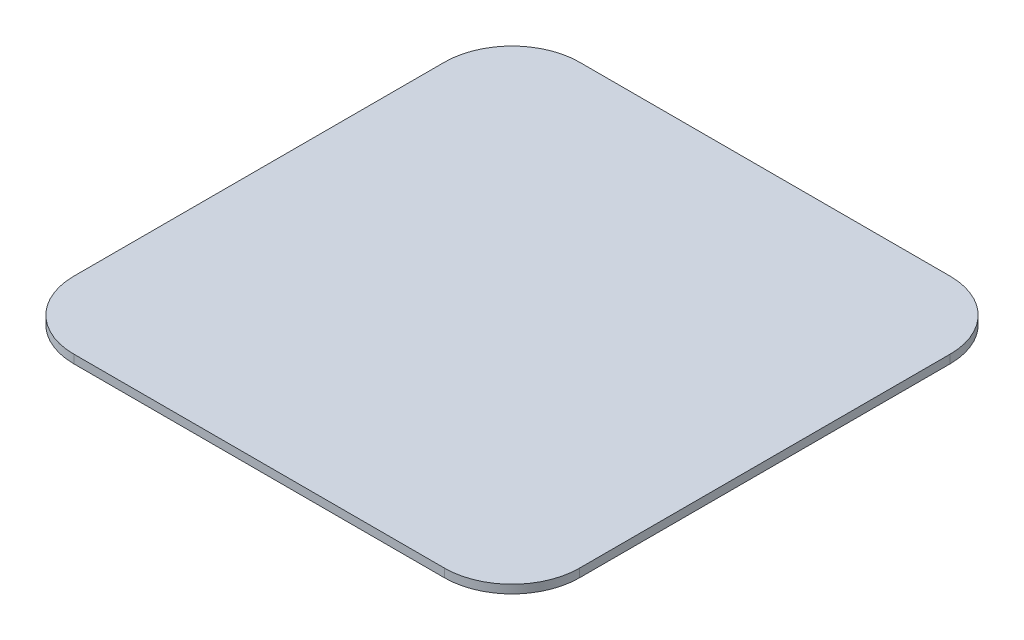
from build123d import *

# Parameters (mm, degrees)
CROQUIS1_W              = 300
CROQUIS1_H              = 300
SALIENTE_EXTRUIR1_DEPTH = 5
REDONDEO1_R             = 40


with BuildPart() as part:
    # Croquis1 → Saliente-Extruir1 (new body)
    with BuildSketch(Plane(origin=(0, 0, 0), x_dir=(1, 0, 0), z_dir=(0, 1, 0))):
        Rectangle(CROQUIS1_W, CROQUIS1_H)
    extrude(amount=SALIENTE_EXTRUIR1_DEPTH)

    # Redondeo1
    redondeo1_edges = [part.edges().sort_by_distance(p)[0] for p in [
        (150, 2.5, 150),
        (-150, 2.5, 150),
        (-150, 2.5, -150),
        (150, 2.5, -150),
    ]]
    fillet(redondeo1_edges, radius=REDONDEO1_R)


solid = part.part
